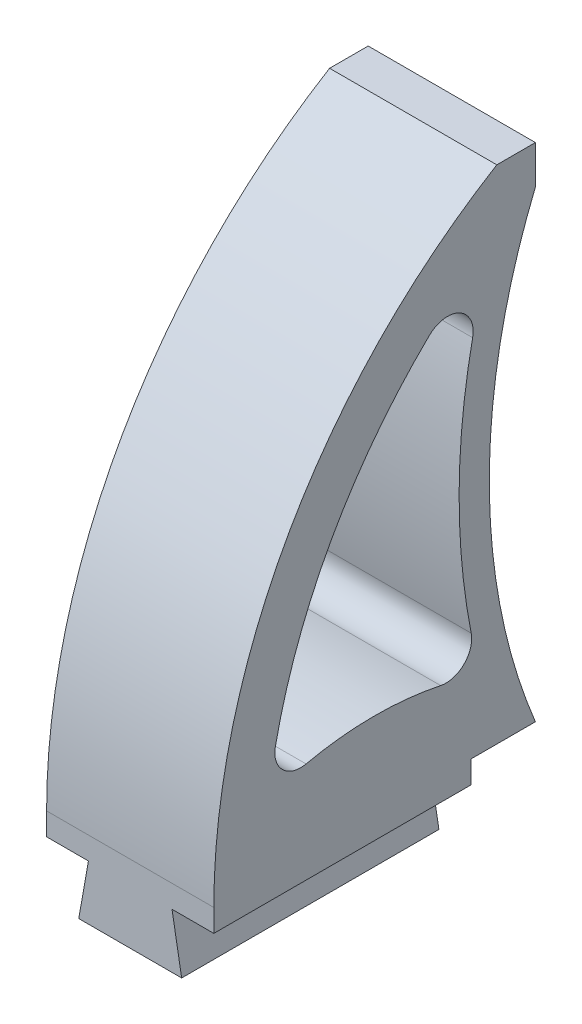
ISO-10303-21;
HEADER;
FILE_DESCRIPTION(('STEP AP214'),'2;1');
FILE_NAME('part.step','',(''),(''),'','','');
FILE_SCHEMA(('AUTOMOTIVE_DESIGN { 1 0 10303 214 1 1 1 1 }'));
ENDSEC;
DATA;
#1=APPLICATION_CONTEXT('core data for automotive mechanical design processes');
#2=APPLICATION_PROTOCOL_DEFINITION('international standard','automotive_design',2000,#1);
#3=PRODUCT_CONTEXT('',#1,'mechanical');
#4=PRODUCT('Part','Part','',(#3));
#5=PRODUCT_RELATED_PRODUCT_CATEGORY('part','',(#4));
#6=PRODUCT_DEFINITION_FORMATION('','',#4);
#7=PRODUCT_DEFINITION_CONTEXT('part definition',#1,'design');
#8=PRODUCT_DEFINITION('design','',#6,#7);
#9=PRODUCT_DEFINITION_SHAPE('','',#8);
#10=(LENGTH_UNIT() NAMED_UNIT(*) SI_UNIT(.MILLI.,.METRE.));
#11=(NAMED_UNIT(*) PLANE_ANGLE_UNIT() SI_UNIT($,.RADIAN.));
#12=(NAMED_UNIT(*) SI_UNIT($,.STERADIAN.) SOLID_ANGLE_UNIT());
#13=UNCERTAINTY_MEASURE_WITH_UNIT(LENGTH_MEASURE(1.E-05),#10,'distance_accuracy_value','');
#14=(GEOMETRIC_REPRESENTATION_CONTEXT(3) GLOBAL_UNCERTAINTY_ASSIGNED_CONTEXT((#13)) GLOBAL_UNIT_ASSIGNED_CONTEXT((#10,
#11,#12)) REPRESENTATION_CONTEXT('',''));
#15=CARTESIAN_POINT('',(0.,0.,0.));
#16=DIRECTION('',(0.,0.,1.));
#17=DIRECTION('',(1.,0.,0.));
#18=AXIS2_PLACEMENT_3D('',#15,#16,#17);
#19=CARTESIAN_POINT('',(6.5,20.7216494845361,-48.4165866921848));
#20=DIRECTION('',(1.,0.,0.));
#21=DIRECTION('',(0.,0.,-1.));
#22=AXIS2_PLACEMENT_3D('',#19,#20,#21);
#23=PLANE('',#22);
#24=DIRECTION('',(0.,0.,1.));
#25=VECTOR('',#24,1.);
#26=CARTESIAN_POINT('',(6.5,0.975110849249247,-4.99999999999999));
#27=LINE('',#26,#25);
#28=CARTESIAN_POINT('',(6.5,0.975110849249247,0.));
#29=VERTEX_POINT('',#28);
#30=CARTESIAN_POINT('',(6.5,0.975110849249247,20.));
#31=VERTEX_POINT('',#30);
#32=EDGE_CURVE('E261',#29,#31,#27,.T.);
#33=ORIENTED_EDGE('',*,*,#32,.F.);
#34=DIRECTION('',(0.,-1.,0.));
#35=VECTOR('',#34,1.);
#36=CARTESIAN_POINT('',(6.5,2.72164948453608,0.));
#37=LINE('',#36,#35);
#38=CARTESIAN_POINT('',(6.5,2.72164948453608,0.));
#39=VERTEX_POINT('',#38);
#40=EDGE_CURVE('E299',#39,#29,#37,.T.);
#41=ORIENTED_EDGE('',*,*,#40,.F.);
#42=DIRECTION('',(0.,0.,1.));
#43=VECTOR('',#42,1.);
#44=CARTESIAN_POINT('',(6.5,2.72164948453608,-5.));
#45=LINE('',#44,#43);
#46=CARTESIAN_POINT('',(6.5,2.7216494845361,-4.99999999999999));
#47=VERTEX_POINT('',#46);
#48=EDGE_CURVE('E291',#47,#39,#45,.T.);
#49=ORIENTED_EDGE('',*,*,#48,.F.);
#50=CARTESIAN_POINT('',(6.5,20.7216494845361,-48.4165866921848));
#51=DIRECTION('',(1.,0.,0.));
#52=DIRECTION('',(0.,0.,-1.));
#53=AXIS2_PLACEMENT_3D('',#50,#51,#52);
#54=CIRCLE('',#53,47.);
#55=CARTESIAN_POINT('',(6.5,38.7216494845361,-4.99999999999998));
#56=VERTEX_POINT('',#55);
#57=EDGE_CURVE('E286',#56,#47,#54,.T.);
#58=ORIENTED_EDGE('',*,*,#57,.F.);
#59=DIRECTION('',(0.,-1.,0.));
#60=VECTOR('',#59,1.);
#61=CARTESIAN_POINT('',(6.5,41.7216494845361,-4.99999999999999));
#62=LINE('',#61,#60);
#63=CARTESIAN_POINT('',(6.5,41.7216494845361,-4.99999999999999));
#64=VERTEX_POINT('',#63);
#65=EDGE_CURVE('E285',#64,#56,#62,.T.);
#66=ORIENTED_EDGE('',*,*,#65,.F.);
#67=DIRECTION('',(0.,0.,-1.));
#68=VECTOR('',#67,1.);
#69=CARTESIAN_POINT('',(6.5,41.7216494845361,-1.99999999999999));
#70=LINE('',#69,#68);
#71=CARTESIAN_POINT('',(6.5,41.7216494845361,-1.99999999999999));
#72=VERTEX_POINT('',#71);
#73=EDGE_CURVE('E306',#72,#64,#70,.T.);
#74=ORIENTED_EDGE('',*,*,#73,.F.);
#75=CARTESIAN_POINT('',(6.5,2.7216494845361,-25.5681818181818));
#76=DIRECTION('',(-1.,0.,0.));
#77=DIRECTION('',(0.,0.,1.));
#78=AXIS2_PLACEMENT_3D('',#75,#76,#77);
#79=CIRCLE('',#78,45.5681818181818);
#80=CARTESIAN_POINT('',(6.5,2.72164948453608,20.));
#81=VERTEX_POINT('',#80);
#82=EDGE_CURVE('E304',#81,#72,#79,.T.);
#83=ORIENTED_EDGE('',*,*,#82,.F.);
#84=DIRECTION('',(0.,1.,0.));
#85=VECTOR('',#84,1.);
#86=CARTESIAN_POINT('',(6.5,-3.27835051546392,20.));
#87=LINE('',#86,#85);
#88=EDGE_CURVE('E303',#31,#81,#87,.T.);
#89=ORIENTED_EDGE('',*,*,#88,.F.);
#90=EDGE_LOOP('',(#33,#41,#49,#58,#66,#74,#83,#89));
#91=FACE_BOUND('',#90,.T.);
#92=CARTESIAN_POINT('',(6.5,10.7998432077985,1.95394618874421));
#93=DIRECTION('',(1.,0.,0.));
#94=DIRECTION('',(0.,0.,-1.));
#95=AXIS2_PLACEMENT_3D('',#92,#93,#94);
#96=CIRCLE('',#95,2.);
#97=CARTESIAN_POINT('',(6.5,8.84249093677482,2.36476498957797));
#98=VERTEX_POINT('',#97);
#99=CARTESIAN_POINT('',(6.5,11.1854698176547,-0.00852473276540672));
#100=VERTEX_POINT('',#99);
#101=EDGE_CURVE('E63',#98,#100,#96,.T.);
#102=ORIENTED_EDGE('',*,*,#101,.F.);
#103=CARTESIAN_POINT('',(6.5,-15.624412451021,7.5));
#104=DIRECTION('',(-1.,0.,0.));
#105=DIRECTION('',(0.,0.,1.));
#106=AXIS2_PLACEMENT_3D('',#103,#104,#105);
#107=CIRCLE('',#106,25.);
#108=CARTESIAN_POINT('',(6.5,8.80074455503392,12.8302631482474));
#109=VERTEX_POINT('',#108);
#110=EDGE_CURVE('E195',#109,#98,#107,.T.);
#111=ORIENTED_EDGE('',*,*,#110,.F.);
#112=CARTESIAN_POINT('',(6.5,10.7547571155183,13.2566842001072));
#113=DIRECTION('',(1.,0.,0.));
#114=DIRECTION('',(0.,0.,1.));
#115=AXIS2_PLACEMENT_3D('',#112,#113,#114);
#116=CIRCLE('',#115,2.);
#117=CARTESIAN_POINT('',(6.5,11.1616195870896,15.2148626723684));
#118=VERTEX_POINT('',#117);
#119=EDGE_CURVE('E198',#118,#109,#116,.T.);
#120=ORIENTED_EDGE('',*,*,#119,.F.);
#121=CARTESIAN_POINT('',(6.5,2.61750768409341,-25.9068852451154));
#122=DIRECTION('',(1.,0.,0.));
#123=DIRECTION('',(0.,0.,1.));
#124=AXIS2_PLACEMENT_3D('',#121,#122,#123);
#125=CIRCLE('',#124,42.);
#126=CARTESIAN_POINT('',(6.5,32.8732308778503,3.2237037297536));
#127=VERTEX_POINT('',#126);
#128=EDGE_CURVE('E218',#127,#118,#125,.T.);
#129=ORIENTED_EDGE('',*,*,#128,.F.);
#130=CARTESIAN_POINT('',(6.5,31.4324821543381,1.8365328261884));
#131=DIRECTION('',(1.,0.,0.));
#132=DIRECTION('',(0.,0.,1.));
#133=AXIS2_PLACEMENT_3D('',#130,#131,#132);
#134=CIRCLE('',#133,2.);
#135=CARTESIAN_POINT('',(6.5,31.0245457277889,-0.121422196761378));
#136=VERTEX_POINT('',#135);
#137=EDGE_CURVE('E214',#136,#127,#134,.T.);
#138=ORIENTED_EDGE('',*,*,#137,.F.);
#139=CARTESIAN_POINT('',(6.5,20.8261350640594,-49.070297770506));
#140=DIRECTION('',(-1.,0.,0.));
#141=DIRECTION('',(0.,0.,-1.));
#142=AXIS2_PLACEMENT_3D('',#139,#140,#141);
#143=CIRCLE('',#142,50.);
#144=EDGE_CURVE('E215',#100,#136,#143,.T.);
#145=ORIENTED_EDGE('',*,*,#144,.F.);
#146=EDGE_LOOP('',(#102,#111,#120,#129,#138,#145));
#147=FACE_BOUND('',#146,.T.);
#148=ADVANCED_FACE('F44',(#91,#147),#23,.T.);
#149=CARTESIAN_POINT('',(-6.5,20.7216494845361,-48.4165866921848));
#150=DIRECTION('',(1.,0.,0.));
#151=DIRECTION('',(0.,0.,-1.));
#152=AXIS2_PLACEMENT_3D('',#149,#150,#151);
#153=PLANE('',#152);
#154=DIRECTION('',(0.,-1.,0.));
#155=VECTOR('',#154,1.);
#156=CARTESIAN_POINT('',(-6.5,2.72164948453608,0.));
#157=LINE('',#156,#155);
#158=CARTESIAN_POINT('',(-6.5,2.72164948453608,0.));
#159=VERTEX_POINT('',#158);
#160=CARTESIAN_POINT('',(-6.5,0.975110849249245,0.));
#161=VERTEX_POINT('',#160);
#162=EDGE_CURVE('E322',#159,#161,#157,.T.);
#163=ORIENTED_EDGE('',*,*,#162,.T.);
#164=DIRECTION('',(0.,0.,1.));
#165=VECTOR('',#164,1.);
#166=CARTESIAN_POINT('',(-6.5,0.975110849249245,-4.99999999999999));
#167=LINE('',#166,#165);
#168=CARTESIAN_POINT('',(-6.5,0.975110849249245,20.));
#169=VERTEX_POINT('',#168);
#170=EDGE_CURVE('E260',#161,#169,#167,.T.);
#171=ORIENTED_EDGE('',*,*,#170,.T.);
#172=DIRECTION('',(0.,1.,0.));
#173=VECTOR('',#172,1.);
#174=CARTESIAN_POINT('',(-6.5,-3.27835051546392,20.));
#175=LINE('',#174,#173);
#176=CARTESIAN_POINT('',(-6.5,2.72164948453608,20.));
#177=VERTEX_POINT('',#176);
#178=EDGE_CURVE('E327',#169,#177,#175,.T.);
#179=ORIENTED_EDGE('',*,*,#178,.T.);
#180=CARTESIAN_POINT('',(-6.5,2.7216494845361,-25.5681818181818));
#181=DIRECTION('',(-1.,0.,0.));
#182=DIRECTION('',(0.,0.,1.));
#183=AXIS2_PLACEMENT_3D('',#180,#181,#182);
#184=CIRCLE('',#183,45.5681818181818);
#185=CARTESIAN_POINT('',(-6.5,41.7216494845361,-1.99999999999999));
#186=VERTEX_POINT('',#185);
#187=EDGE_CURVE('E332',#177,#186,#184,.T.);
#188=ORIENTED_EDGE('',*,*,#187,.T.);
#189=DIRECTION('',(0.,0.,-1.));
#190=VECTOR('',#189,1.);
#191=CARTESIAN_POINT('',(-6.5,41.7216494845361,-1.99999999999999));
#192=LINE('',#191,#190);
#193=CARTESIAN_POINT('',(-6.5,41.7216494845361,-4.99999999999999));
#194=VERTEX_POINT('',#193);
#195=EDGE_CURVE('E289',#186,#194,#192,.T.);
#196=ORIENTED_EDGE('',*,*,#195,.T.);
#197=DIRECTION('',(0.,-1.,0.));
#198=VECTOR('',#197,1.);
#199=CARTESIAN_POINT('',(-6.5,41.7216494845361,-4.99999999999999));
#200=LINE('',#199,#198);
#201=CARTESIAN_POINT('',(-6.5,38.7216494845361,-4.99999999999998));
#202=VERTEX_POINT('',#201);
#203=EDGE_CURVE('E282',#194,#202,#200,.T.);
#204=ORIENTED_EDGE('',*,*,#203,.T.);
#205=CARTESIAN_POINT('',(-6.5,20.7216494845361,-48.4165866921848));
#206=DIRECTION('',(1.,0.,0.));
#207=DIRECTION('',(0.,0.,-1.));
#208=AXIS2_PLACEMENT_3D('',#205,#206,#207);
#209=CIRCLE('',#208,47.);
#210=CARTESIAN_POINT('',(-6.5,2.7216494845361,-4.99999999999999));
#211=VERTEX_POINT('',#210);
#212=EDGE_CURVE('E316',#202,#211,#209,.T.);
#213=ORIENTED_EDGE('',*,*,#212,.T.);
#214=DIRECTION('',(0.,0.,1.));
#215=VECTOR('',#214,1.);
#216=CARTESIAN_POINT('',(-6.5,2.72164948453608,-5.));
#217=LINE('',#216,#215);
#218=EDGE_CURVE('E319',#211,#159,#217,.T.);
#219=ORIENTED_EDGE('',*,*,#218,.T.);
#220=EDGE_LOOP('',(#163,#171,#179,#188,#196,#204,#213,#219));
#221=FACE_BOUND('',#220,.T.);
#222=CARTESIAN_POINT('',(-6.5,-15.624412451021,7.5));
#223=DIRECTION('',(-1.,0.,0.));
#224=DIRECTION('',(0.,0.,1.));
#225=AXIS2_PLACEMENT_3D('',#222,#223,#224);
#226=CIRCLE('',#225,25.);
#227=CARTESIAN_POINT('',(-6.5,8.80074455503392,12.8302631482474));
#228=VERTEX_POINT('',#227);
#229=CARTESIAN_POINT('',(-6.5,8.84249093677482,2.36476498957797));
#230=VERTEX_POINT('',#229);
#231=EDGE_CURVE('E177',#228,#230,#226,.T.);
#232=ORIENTED_EDGE('',*,*,#231,.T.);
#233=CARTESIAN_POINT('',(-6.5,10.7998432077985,1.95394618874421));
#234=DIRECTION('',(1.,0.,0.));
#235=DIRECTION('',(0.,0.,-1.));
#236=AXIS2_PLACEMENT_3D('',#233,#234,#235);
#237=CIRCLE('',#236,2.);
#238=CARTESIAN_POINT('',(-6.5,11.1854698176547,-0.00852473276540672));
#239=VERTEX_POINT('',#238);
#240=EDGE_CURVE('E172',#230,#239,#237,.T.);
#241=ORIENTED_EDGE('',*,*,#240,.T.);
#242=CARTESIAN_POINT('',(-6.5,20.8261350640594,-49.070297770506));
#243=DIRECTION('',(-1.,0.,0.));
#244=DIRECTION('',(0.,0.,-1.));
#245=AXIS2_PLACEMENT_3D('',#242,#243,#244);
#246=CIRCLE('',#245,50.);
#247=CARTESIAN_POINT('',(-6.5,31.0245457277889,-0.121422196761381));
#248=VERTEX_POINT('',#247);
#249=EDGE_CURVE('E181',#239,#248,#246,.T.);
#250=ORIENTED_EDGE('',*,*,#249,.T.);
#251=CARTESIAN_POINT('',(-6.5,31.4324821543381,1.8365328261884));
#252=DIRECTION('',(1.,0.,0.));
#253=DIRECTION('',(0.,0.,1.));
#254=AXIS2_PLACEMENT_3D('',#251,#252,#253);
#255=CIRCLE('',#254,2.);
#256=CARTESIAN_POINT('',(-6.5,32.8732308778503,3.2237037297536));
#257=VERTEX_POINT('',#256);
#258=EDGE_CURVE('E69',#248,#257,#255,.T.);
#259=ORIENTED_EDGE('',*,*,#258,.T.);
#260=CARTESIAN_POINT('',(-6.5,2.61750768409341,-25.9068852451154));
#261=DIRECTION('',(1.,0.,0.));
#262=DIRECTION('',(0.,0.,1.));
#263=AXIS2_PLACEMENT_3D('',#260,#261,#262);
#264=CIRCLE('',#263,42.);
#265=CARTESIAN_POINT('',(-6.5,11.1616195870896,15.2148626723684));
#266=VERTEX_POINT('',#265);
#267=EDGE_CURVE('E203',#257,#266,#264,.T.);
#268=ORIENTED_EDGE('',*,*,#267,.T.);
#269=CARTESIAN_POINT('',(-6.5,10.7547571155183,13.2566842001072));
#270=DIRECTION('',(1.,0.,0.));
#271=DIRECTION('',(0.,0.,1.));
#272=AXIS2_PLACEMENT_3D('',#269,#270,#271);
#273=CIRCLE('',#272,2.);
#274=EDGE_CURVE('E202',#266,#228,#273,.T.);
#275=ORIENTED_EDGE('',*,*,#274,.T.);
#276=EDGE_LOOP('',(#232,#241,#250,#259,#268,#275));
#277=FACE_BOUND('',#276,.T.);
#278=ADVANCED_FACE('F187',(#221,#277),#153,.F.);
#279=CARTESIAN_POINT('',(6.5,-3.27835051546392,20.));
#280=DIRECTION('',(0.,0.,1.));
#281=DIRECTION('',(0.,-1.,0.));
#282=AXIS2_PLACEMENT_3D('',#279,#280,#281);
#283=PLANE('',#282);
#284=ORIENTED_EDGE('',*,*,#178,.F.);
#285=DIRECTION('',(1.,0.,0.));
#286=VECTOR('',#285,1.);
#287=CARTESIAN_POINT('',(0.,0.975110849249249,20.));
#288=LINE('',#287,#286);
#289=CARTESIAN_POINT('',(-3.25,0.975110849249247,20.));
#290=VERTEX_POINT('',#289);
#291=EDGE_CURVE('E243',#169,#290,#288,.T.);
#292=ORIENTED_EDGE('',*,*,#291,.T.);
#293=DIRECTION('',(-0.173648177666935,-0.984807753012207,0.));
#294=VECTOR('',#293,1.);
#295=CARTESIAN_POINT('',(-3.31875428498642,0.585185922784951,20.));
#296=LINE('',#295,#294);
#297=CARTESIAN_POINT('',(-4.,-3.27835051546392,20.));
#298=VERTEX_POINT('',#297);
#299=EDGE_CURVE('E241',#290,#298,#296,.T.);
#300=ORIENTED_EDGE('',*,*,#299,.T.);
#301=DIRECTION('',(-1.,0.,0.));
#302=VECTOR('',#301,1.);
#303=CARTESIAN_POINT('',(6.5,-3.27835051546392,20.));
#304=LINE('',#303,#302);
#305=CARTESIAN_POINT('',(4.,-3.27835051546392,20.));
#306=VERTEX_POINT('',#305);
#307=EDGE_CURVE('E350',#306,#298,#304,.T.);
#308=ORIENTED_EDGE('',*,*,#307,.F.);
#309=DIRECTION('',(0.173648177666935,-0.984807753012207,0.));
#310=VECTOR('',#309,1.);
#311=CARTESIAN_POINT('',(3.25,0.975110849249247,20.));
#312=LINE('',#311,#310);
#313=CARTESIAN_POINT('',(3.25,0.975110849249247,20.));
#314=VERTEX_POINT('',#313);
#315=EDGE_CURVE('E268',#314,#306,#312,.T.);
#316=ORIENTED_EDGE('',*,*,#315,.F.);
#317=DIRECTION('',(-1.,0.,0.));
#318=VECTOR('',#317,1.);
#319=CARTESIAN_POINT('',(6.5,0.975110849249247,20.));
#320=LINE('',#319,#318);
#321=EDGE_CURVE('E248',#31,#314,#320,.T.);
#322=ORIENTED_EDGE('',*,*,#321,.F.);
#323=ORIENTED_EDGE('',*,*,#88,.T.);
#324=DIRECTION('',(-1.,0.,0.));
#325=VECTOR('',#324,1.);
#326=CARTESIAN_POINT('',(6.5,2.72164948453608,20.));
#327=LINE('',#326,#325);
#328=EDGE_CURVE('E341',#81,#177,#327,.T.);
#329=ORIENTED_EDGE('',*,*,#328,.T.);
#330=EDGE_LOOP('',(#284,#292,#300,#308,#316,#322,#323,#329));
#331=FACE_BOUND('',#330,.T.);
#332=ADVANCED_FACE('F384',(#331),#283,.T.);
#333=CARTESIAN_POINT('',(6.5,-3.27835051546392,0.));
#334=DIRECTION('',(0.,-1.,0.));
#335=DIRECTION('',(0.,0.,-1.));
#336=AXIS2_PLACEMENT_3D('',#333,#334,#335);
#337=PLANE('',#336);
#338=DIRECTION('',(0.,0.,1.));
#339=VECTOR('',#338,1.);
#340=CARTESIAN_POINT('',(-4.,-3.27835051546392,-4.99999999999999));
#341=LINE('',#340,#339);
#342=CARTESIAN_POINT('',(-4.,-3.27835051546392,0.));
#343=VERTEX_POINT('',#342);
#344=EDGE_CURVE('E247',#343,#298,#341,.T.);
#345=ORIENTED_EDGE('',*,*,#344,.F.);
#346=DIRECTION('',(-1.,0.,0.));
#347=VECTOR('',#346,1.);
#348=CARTESIAN_POINT('',(6.5,-3.27835051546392,0.));
#349=LINE('',#348,#347);
#350=CARTESIAN_POINT('',(4.,-3.27835051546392,0.));
#351=VERTEX_POINT('',#350);
#352=EDGE_CURVE('E353',#351,#343,#349,.T.);
#353=ORIENTED_EDGE('',*,*,#352,.F.);
#354=DIRECTION('',(0.,0.,1.));
#355=VECTOR('',#354,1.);
#356=CARTESIAN_POINT('',(4.,-3.27835051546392,-4.99999999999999));
#357=LINE('',#356,#355);
#358=EDGE_CURVE('E230',#351,#306,#357,.T.);
#359=ORIENTED_EDGE('',*,*,#358,.T.);
#360=ORIENTED_EDGE('',*,*,#307,.T.);
#361=EDGE_LOOP('',(#345,#353,#359,#360));
#362=FACE_BOUND('',#361,.T.);
#363=ADVANCED_FACE('F414',(#362),#337,.T.);
#364=CARTESIAN_POINT('',(6.5,2.72164948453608,0.));
#365=DIRECTION('',(0.,0.,-1.));
#366=DIRECTION('',(-1.,0.,0.));
#367=AXIS2_PLACEMENT_3D('',#364,#365,#366);
#368=PLANE('',#367);
#369=DIRECTION('',(0.173648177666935,0.984807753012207,0.));
#370=VECTOR('',#369,1.);
#371=CARTESIAN_POINT('',(-2.65732582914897,4.3363330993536,0.));
#372=LINE('',#371,#370);
#373=CARTESIAN_POINT('',(-3.25,0.975110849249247,0.));
#374=VERTEX_POINT('',#373);
#375=EDGE_CURVE('E11',#343,#374,#372,.T.);
#376=ORIENTED_EDGE('',*,*,#375,.T.);
#377=DIRECTION('',(-1.,0.,0.));
#378=VECTOR('',#377,1.);
#379=CARTESIAN_POINT('',(6.5,0.975110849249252,0.));
#380=LINE('',#379,#378);
#381=EDGE_CURVE('E255',#374,#161,#380,.T.);
#382=ORIENTED_EDGE('',*,*,#381,.T.);
#383=ORIENTED_EDGE('',*,*,#162,.F.);
#384=DIRECTION('',(-1.,0.,0.));
#385=VECTOR('',#384,1.);
#386=CARTESIAN_POINT('',(6.5,2.72164948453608,0.));
#387=LINE('',#386,#385);
#388=EDGE_CURVE('E351',#39,#159,#387,.T.);
#389=ORIENTED_EDGE('',*,*,#388,.F.);
#390=ORIENTED_EDGE('',*,*,#40,.T.);
#391=DIRECTION('',(1.,0.,0.));
#392=VECTOR('',#391,1.);
#393=CARTESIAN_POINT('',(6.5,0.975110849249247,0.));
#394=LINE('',#393,#392);
#395=CARTESIAN_POINT('',(3.25,0.975110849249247,0.));
#396=VERTEX_POINT('',#395);
#397=EDGE_CURVE('E278',#396,#29,#394,.T.);
#398=ORIENTED_EDGE('',*,*,#397,.F.);
#399=DIRECTION('',(-0.173648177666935,0.984807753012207,0.));
#400=VECTOR('',#399,1.);
#401=CARTESIAN_POINT('',(3.04932379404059,2.1132021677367,0.));
#402=LINE('',#401,#400);
#403=EDGE_CURVE('E53',#351,#396,#402,.T.);
#404=ORIENTED_EDGE('',*,*,#403,.F.);
#405=ORIENTED_EDGE('',*,*,#352,.T.);
#406=EDGE_LOOP('',(#376,#382,#383,#389,#390,#398,#404,#405));
#407=FACE_BOUND('',#406,.T.);
#408=ADVANCED_FACE('F367',(#407),#368,.T.);
#409=CARTESIAN_POINT('',(6.5,41.7216494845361,-4.99999999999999));
#410=DIRECTION('',(0.,0.,-1.));
#411=DIRECTION('',(0.,1.,0.));
#412=AXIS2_PLACEMENT_3D('',#409,#410,#411);
#413=PLANE('',#412);
#414=ORIENTED_EDGE('',*,*,#203,.F.);
#415=DIRECTION('',(-1.,0.,0.));
#416=VECTOR('',#415,1.);
#417=CARTESIAN_POINT('',(6.5,41.7216494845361,-4.99999999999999));
#418=LINE('',#417,#416);
#419=EDGE_CURVE('E265',#64,#194,#418,.T.);
#420=ORIENTED_EDGE('',*,*,#419,.F.);
#421=ORIENTED_EDGE('',*,*,#65,.T.);
#422=DIRECTION('',(-1.,0.,0.));
#423=VECTOR('',#422,1.);
#424=CARTESIAN_POINT('',(6.5,38.7216494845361,-4.99999999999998));
#425=LINE('',#424,#423);
#426=EDGE_CURVE('E315',#56,#202,#425,.T.);
#427=ORIENTED_EDGE('',*,*,#426,.T.);
#428=EDGE_LOOP('',(#414,#420,#421,#427));
#429=FACE_BOUND('',#428,.T.);
#430=ADVANCED_FACE('F50',(#429),#413,.T.);
#431=CARTESIAN_POINT('',(6.5,41.7216494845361,-1.99999999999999));
#432=DIRECTION('',(0.,1.,0.));
#433=DIRECTION('',(0.,0.,1.));
#434=AXIS2_PLACEMENT_3D('',#431,#432,#433);
#435=PLANE('',#434);
#436=ORIENTED_EDGE('',*,*,#195,.F.);
#437=DIRECTION('',(-1.,0.,0.));
#438=VECTOR('',#437,1.);
#439=CARTESIAN_POINT('',(6.5,41.7216494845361,-1.99999999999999));
#440=LINE('',#439,#438);
#441=EDGE_CURVE('E336',#72,#186,#440,.T.);
#442=ORIENTED_EDGE('',*,*,#441,.F.);
#443=ORIENTED_EDGE('',*,*,#73,.T.);
#444=ORIENTED_EDGE('',*,*,#419,.T.);
#445=EDGE_LOOP('',(#436,#442,#443,#444));
#446=FACE_BOUND('',#445,.T.);
#447=ADVANCED_FACE('F392',(#446),#435,.T.);
#448=CARTESIAN_POINT('',(6.5,2.7216494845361,-25.5681818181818));
#449=DIRECTION('',(-1.,0.,0.));
#450=DIRECTION('',(0.,0.,1.));
#451=AXIS2_PLACEMENT_3D('',#448,#449,#450);
#452=CYLINDRICAL_SURFACE('',#451,45.5681818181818);
#453=ORIENTED_EDGE('',*,*,#187,.F.);
#454=ORIENTED_EDGE('',*,*,#328,.F.);
#455=ORIENTED_EDGE('',*,*,#82,.T.);
#456=ORIENTED_EDGE('',*,*,#441,.T.);
#457=EDGE_LOOP('',(#453,#454,#455,#456));
#458=FACE_BOUND('',#457,.T.);
#459=ADVANCED_FACE('F386',(#458),#452,.T.);
#460=CARTESIAN_POINT('',(6.5,2.72164948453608,-5.));
#461=DIRECTION('',(0.,-1.,0.));
#462=DIRECTION('',(0.,0.,-1.));
#463=AXIS2_PLACEMENT_3D('',#460,#461,#462);
#464=PLANE('',#463);
#465=ORIENTED_EDGE('',*,*,#218,.F.);
#466=DIRECTION('',(-1.,0.,0.));
#467=VECTOR('',#466,1.);
#468=CARTESIAN_POINT('',(6.5,2.7216494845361,-4.99999999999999));
#469=LINE('',#468,#467);
#470=EDGE_CURVE('E356',#47,#211,#469,.T.);
#471=ORIENTED_EDGE('',*,*,#470,.F.);
#472=ORIENTED_EDGE('',*,*,#48,.T.);
#473=ORIENTED_EDGE('',*,*,#388,.T.);
#474=EDGE_LOOP('',(#465,#471,#472,#473));
#475=FACE_BOUND('',#474,.T.);
#476=ADVANCED_FACE('F401',(#475),#464,.T.);
#477=CARTESIAN_POINT('',(6.5,20.7216494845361,-48.4165866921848));
#478=DIRECTION('',(-1.,0.,0.));
#479=DIRECTION('',(0.,0.,1.));
#480=AXIS2_PLACEMENT_3D('',#477,#478,#479);
#481=CYLINDRICAL_SURFACE('',#480,47.);
#482=ORIENTED_EDGE('',*,*,#212,.F.);
#483=ORIENTED_EDGE('',*,*,#426,.F.);
#484=ORIENTED_EDGE('',*,*,#57,.T.);
#485=ORIENTED_EDGE('',*,*,#470,.T.);
#486=EDGE_LOOP('',(#482,#483,#484,#485));
#487=FACE_BOUND('',#486,.T.);
#488=ADVANCED_FACE('F397',(#487),#481,.F.);
#489=CARTESIAN_POINT('',(3.25,0.975110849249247,-4.99999999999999));
#490=DIRECTION('',(-0.984807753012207,-0.173648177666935,0.));
#491=DIRECTION('',(0.173648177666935,-0.984807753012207,0.));
#492=AXIS2_PLACEMENT_3D('',#489,#490,#491);
#493=PLANE('',#492);
#494=ORIENTED_EDGE('',*,*,#403,.T.);
#495=DIRECTION('',(0.,0.,1.));
#496=VECTOR('',#495,1.);
#497=CARTESIAN_POINT('',(3.25,0.975110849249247,-4.99999999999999));
#498=LINE('',#497,#496);
#499=EDGE_CURVE('E264',#396,#314,#498,.T.);
#500=ORIENTED_EDGE('',*,*,#499,.T.);
#501=ORIENTED_EDGE('',*,*,#315,.T.);
#502=ORIENTED_EDGE('',*,*,#358,.F.);
#503=EDGE_LOOP('',(#494,#500,#501,#502));
#504=FACE_BOUND('',#503,.T.);
#505=ADVANCED_FACE('F370',(#504),#493,.F.);
#506=CARTESIAN_POINT('',(6.5,0.975110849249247,-4.99999999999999));
#507=DIRECTION('',(0.,1.,0.));
#508=DIRECTION('',(0.,0.,1.));
#509=AXIS2_PLACEMENT_3D('',#506,#507,#508);
#510=PLANE('',#509);
#511=ORIENTED_EDGE('',*,*,#397,.T.);
#512=ORIENTED_EDGE('',*,*,#32,.T.);
#513=ORIENTED_EDGE('',*,*,#321,.T.);
#514=ORIENTED_EDGE('',*,*,#499,.F.);
#515=EDGE_LOOP('',(#511,#512,#513,#514));
#516=FACE_BOUND('',#515,.T.);
#517=ADVANCED_FACE('F372',(#516),#510,.F.);
#518=CARTESIAN_POINT('',(0.,0.975110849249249,-4.99999999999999));
#519=DIRECTION('',(0.,-1.,0.));
#520=DIRECTION('',(1.,0.,0.));
#521=AXIS2_PLACEMENT_3D('',#518,#519,#520);
#522=PLANE('',#521);
#523=DIRECTION('',(0.,0.,1.));
#524=VECTOR('',#523,1.);
#525=CARTESIAN_POINT('',(-3.25,0.975110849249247,-4.99999999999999));
#526=LINE('',#525,#524);
#527=EDGE_CURVE('E253',#374,#290,#526,.T.);
#528=ORIENTED_EDGE('',*,*,#527,.T.);
#529=ORIENTED_EDGE('',*,*,#291,.F.);
#530=ORIENTED_EDGE('',*,*,#170,.F.);
#531=ORIENTED_EDGE('',*,*,#381,.F.);
#532=EDGE_LOOP('',(#528,#529,#530,#531));
#533=FACE_BOUND('',#532,.T.);
#534=ADVANCED_FACE('F410',(#533),#522,.T.);
#535=CARTESIAN_POINT('',(-3.31875428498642,0.585185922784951,-4.99999999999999));
#536=DIRECTION('',(-0.984807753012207,0.173648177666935,0.));
#537=DIRECTION('',(-0.173648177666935,-0.984807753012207,0.));
#538=AXIS2_PLACEMENT_3D('',#535,#536,#537);
#539=PLANE('',#538);
#540=ORIENTED_EDGE('',*,*,#344,.T.);
#541=ORIENTED_EDGE('',*,*,#299,.F.);
#542=ORIENTED_EDGE('',*,*,#527,.F.);
#543=ORIENTED_EDGE('',*,*,#375,.F.);
#544=EDGE_LOOP('',(#540,#541,#542,#543));
#545=FACE_BOUND('',#544,.T.);
#546=ADVANCED_FACE('F413',(#545),#539,.T.);
#547=CARTESIAN_POINT('',(-6.5,10.7998432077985,1.95394618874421));
#548=DIRECTION('',(1.,0.,0.));
#549=DIRECTION('',(0.,0.,-1.));
#550=AXIS2_PLACEMENT_3D('',#547,#548,#549);
#551=CYLINDRICAL_SURFACE('',#550,2.);
#552=ORIENTED_EDGE('',*,*,#101,.T.);
#553=DIRECTION('',(1.,0.,0.));
#554=VECTOR('',#553,1.);
#555=CARTESIAN_POINT('',(-6.5,11.1854698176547,-0.00852473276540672));
#556=LINE('',#555,#554);
#557=EDGE_CURVE('E166',#239,#100,#556,.T.);
#558=ORIENTED_EDGE('',*,*,#557,.F.);
#559=ORIENTED_EDGE('',*,*,#240,.F.);
#560=DIRECTION('',(1.,0.,0.));
#561=VECTOR('',#560,1.);
#562=CARTESIAN_POINT('',(-6.5,8.84249093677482,2.36476498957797));
#563=LINE('',#562,#561);
#564=EDGE_CURVE('E228',#230,#98,#563,.T.);
#565=ORIENTED_EDGE('',*,*,#564,.T.);
#566=EDGE_LOOP('',(#552,#558,#559,#565));
#567=FACE_BOUND('',#566,.T.);
#568=ADVANCED_FACE('F173',(#567),#551,.F.);
#569=CARTESIAN_POINT('',(-6.5,-15.624412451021,7.5));
#570=DIRECTION('',(1.,0.,0.));
#571=DIRECTION('',(0.,0.,-1.));
#572=AXIS2_PLACEMENT_3D('',#569,#570,#571);
#573=CYLINDRICAL_SURFACE('',#572,25.);
#574=ORIENTED_EDGE('',*,*,#110,.T.);
#575=ORIENTED_EDGE('',*,*,#564,.F.);
#576=ORIENTED_EDGE('',*,*,#231,.F.);
#577=DIRECTION('',(1.,0.,0.));
#578=VECTOR('',#577,1.);
#579=CARTESIAN_POINT('',(-6.5,8.80074455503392,12.8302631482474));
#580=LINE('',#579,#578);
#581=EDGE_CURVE('E226',#228,#109,#580,.T.);
#582=ORIENTED_EDGE('',*,*,#581,.T.);
#583=EDGE_LOOP('',(#574,#575,#576,#582));
#584=FACE_BOUND('',#583,.T.);
#585=ADVANCED_FACE('F460',(#584),#573,.T.);
#586=CARTESIAN_POINT('',(-6.5,10.7547571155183,13.2566842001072));
#587=DIRECTION('',(1.,0.,0.));
#588=DIRECTION('',(0.,0.,-1.));
#589=AXIS2_PLACEMENT_3D('',#586,#587,#588);
#590=CYLINDRICAL_SURFACE('',#589,2.);
#591=ORIENTED_EDGE('',*,*,#119,.T.);
#592=ORIENTED_EDGE('',*,*,#581,.F.);
#593=ORIENTED_EDGE('',*,*,#274,.F.);
#594=DIRECTION('',(1.,0.,0.));
#595=VECTOR('',#594,1.);
#596=CARTESIAN_POINT('',(-6.5,11.1616195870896,15.2148626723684));
#597=LINE('',#596,#595);
#598=EDGE_CURVE('E231',#266,#118,#597,.T.);
#599=ORIENTED_EDGE('',*,*,#598,.T.);
#600=EDGE_LOOP('',(#591,#592,#593,#599));
#601=FACE_BOUND('',#600,.T.);
#602=ADVANCED_FACE('F468',(#601),#590,.F.);
#603=CARTESIAN_POINT('',(-6.5,2.61750768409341,-25.9068852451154));
#604=DIRECTION('',(1.,0.,0.));
#605=DIRECTION('',(0.,0.,-1.));
#606=AXIS2_PLACEMENT_3D('',#603,#604,#605);
#607=CYLINDRICAL_SURFACE('',#606,42.);
#608=ORIENTED_EDGE('',*,*,#128,.T.);
#609=ORIENTED_EDGE('',*,*,#598,.F.);
#610=ORIENTED_EDGE('',*,*,#267,.F.);
#611=DIRECTION('',(1.,0.,0.));
#612=VECTOR('',#611,1.);
#613=CARTESIAN_POINT('',(-6.5,32.8732308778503,3.2237037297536));
#614=LINE('',#613,#612);
#615=EDGE_CURVE('E237',#257,#127,#614,.T.);
#616=ORIENTED_EDGE('',*,*,#615,.T.);
#617=EDGE_LOOP('',(#608,#609,#610,#616));
#618=FACE_BOUND('',#617,.T.);
#619=ADVANCED_FACE('F462',(#618),#607,.F.);
#620=CARTESIAN_POINT('',(-6.5,31.4324821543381,1.8365328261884));
#621=DIRECTION('',(1.,0.,0.));
#622=DIRECTION('',(0.,0.,-1.));
#623=AXIS2_PLACEMENT_3D('',#620,#621,#622);
#624=CYLINDRICAL_SURFACE('',#623,2.);
#625=ORIENTED_EDGE('',*,*,#137,.T.);
#626=ORIENTED_EDGE('',*,*,#615,.F.);
#627=ORIENTED_EDGE('',*,*,#258,.F.);
#628=DIRECTION('',(1.,0.,0.));
#629=VECTOR('',#628,1.);
#630=CARTESIAN_POINT('',(-6.5,31.0245457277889,-0.121422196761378));
#631=LINE('',#630,#629);
#632=EDGE_CURVE('E179',#248,#136,#631,.T.);
#633=ORIENTED_EDGE('',*,*,#632,.T.);
#634=EDGE_LOOP('',(#625,#626,#627,#633));
#635=FACE_BOUND('',#634,.T.);
#636=ADVANCED_FACE('F458',(#635),#624,.F.);
#637=CARTESIAN_POINT('',(-6.5,20.8261350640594,-49.070297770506));
#638=DIRECTION('',(1.,0.,0.));
#639=DIRECTION('',(0.,0.,-1.));
#640=AXIS2_PLACEMENT_3D('',#637,#638,#639);
#641=CYLINDRICAL_SURFACE('',#640,50.);
#642=ORIENTED_EDGE('',*,*,#144,.T.);
#643=ORIENTED_EDGE('',*,*,#632,.F.);
#644=ORIENTED_EDGE('',*,*,#249,.F.);
#645=ORIENTED_EDGE('',*,*,#557,.T.);
#646=EDGE_LOOP('',(#642,#643,#644,#645));
#647=FACE_BOUND('',#646,.T.);
#648=ADVANCED_FACE('F184',(#647),#641,.T.);
#649=CLOSED_SHELL('',(#148,#278,#332,#363,#408,#430,#447,#459,#476,#488,#505,#517,#534,#546,
#568,#585,#602,#619,#636,#648));
#650=MANIFOLD_SOLID_BREP('B2',#649);
#651=ADVANCED_BREP_SHAPE_REPRESENTATION('',(#18,#650),#14);
#652=SHAPE_DEFINITION_REPRESENTATION(#9,#651);
ENDSEC;
END-ISO-10303-21;
